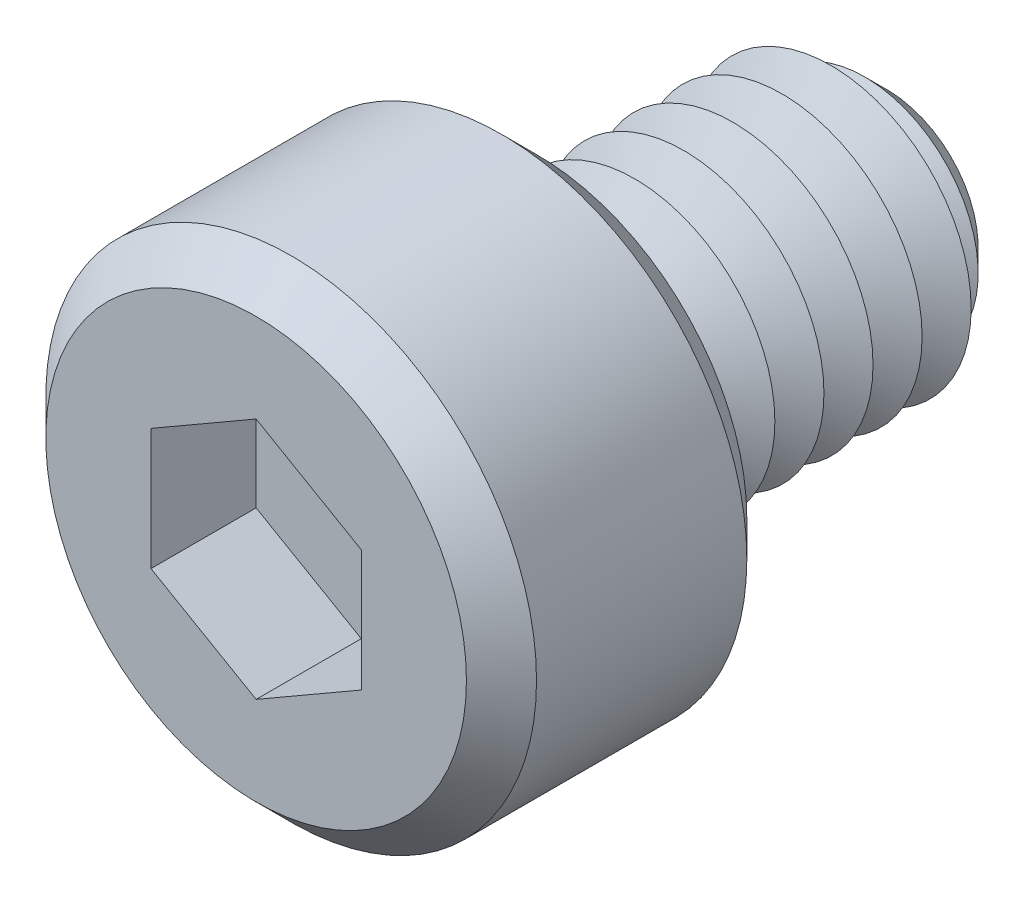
from build123d import *

# Parameters (mm, degrees)
SKETCH1_R           = 3.5
BOSS_EXTRUDE1_DEPTH = 4
SKETCH2_R           = 2
BOSS_EXTRUDE2_DEPTH = 5
CHAMFER1_SIZE       = 0.7
LPATTERN1_COUNT     = 7
LPATTERN1_PITCH     = 0.7
CUT_EXTRUDE1_DEPTH  = 1.5
SKETCH6_R           = 0.5
CUT_EXTRUDE2_DEPTH  = 7.5
CHAMFER2_SIZE       = 0.5


with BuildPart() as part:
    # Sketch1 → Boss-Extrude1 (new body)
    with BuildSketch(Plane.XY):
        Circle(SKETCH1_R)
    extrude(amount=BOSS_EXTRUDE1_DEPTH)

    # Sketch2 → Boss-Extrude2 (add)
    with BuildSketch(Plane(origin=(0, 0, 0), x_dir=(-1, 0, 0), z_dir=(0, 0, -1))):
        Circle(SKETCH2_R)
    extrude(amount=BOSS_EXTRUDE2_DEPTH)

    # Chamfer1
    chamfer1_edges = [part.edges().sort_by_distance(p)[0] for p in [
        (2, 0, -5),
    ]]
    chamfer(chamfer1_edges, length=CHAMFER1_SIZE)

    # Sketch4 → Cut-Revolve1 (revolve, cut)
    with BuildSketch(Plane(origin=(0, 0, 0), x_dir=(0, 0, -1), z_dir=(1, 0, 0)), mode=Mode.PRIVATE) as cut_revolve1_sk:
        Polygon((0, 2), (0.35, 1.393782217), (0.7, 2), align=None)
    cut_revolve1 = revolve(cut_revolve1_sk.sketch.rotate(Axis((0, 0, 2.512122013), (0, 0, -1)), 90), axis=Axis((0, 0, 2.512122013), (0, 0, -1)), mode=Mode.SUBTRACT)

    # LPattern1: Cut-Revolve1 ×7
    with Locations(*[(0, 0, -i * LPATTERN1_PITCH) for i in range(1, LPATTERN1_COUNT)]):
        add(cut_revolve1, mode=Mode.SUBTRACT)

    # Sketch5 → Cut-Extrude1 (cut)
    with BuildSketch(Plane.XY.offset(4)):
        Polygon((0, 1.732050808), (-1.5, 0.866025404), (-1.5, -0.866025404), (0, -1.732050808), (1.5, -0.866025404), (1.5, 0.866025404), align=None)
    extrude(amount=-CUT_EXTRUDE1_DEPTH, mode=Mode.SUBTRACT)

    # Sketch6 → Cut-Extrude2 (cut)
    with BuildSketch(Plane.XY.offset(2.5)):
        Circle(SKETCH6_R)
    extrude(amount=-CUT_EXTRUDE2_DEPTH, mode=Mode.SUBTRACT)

    # Chamfer2
    chamfer2_edges = [part.edges().sort_by_distance(p)[0] for p in [
        (-3.5, 0, 0),
        (-3.5, 0, 4),
    ]]
    chamfer(chamfer2_edges, length=CHAMFER2_SIZE)


solid = part.part
